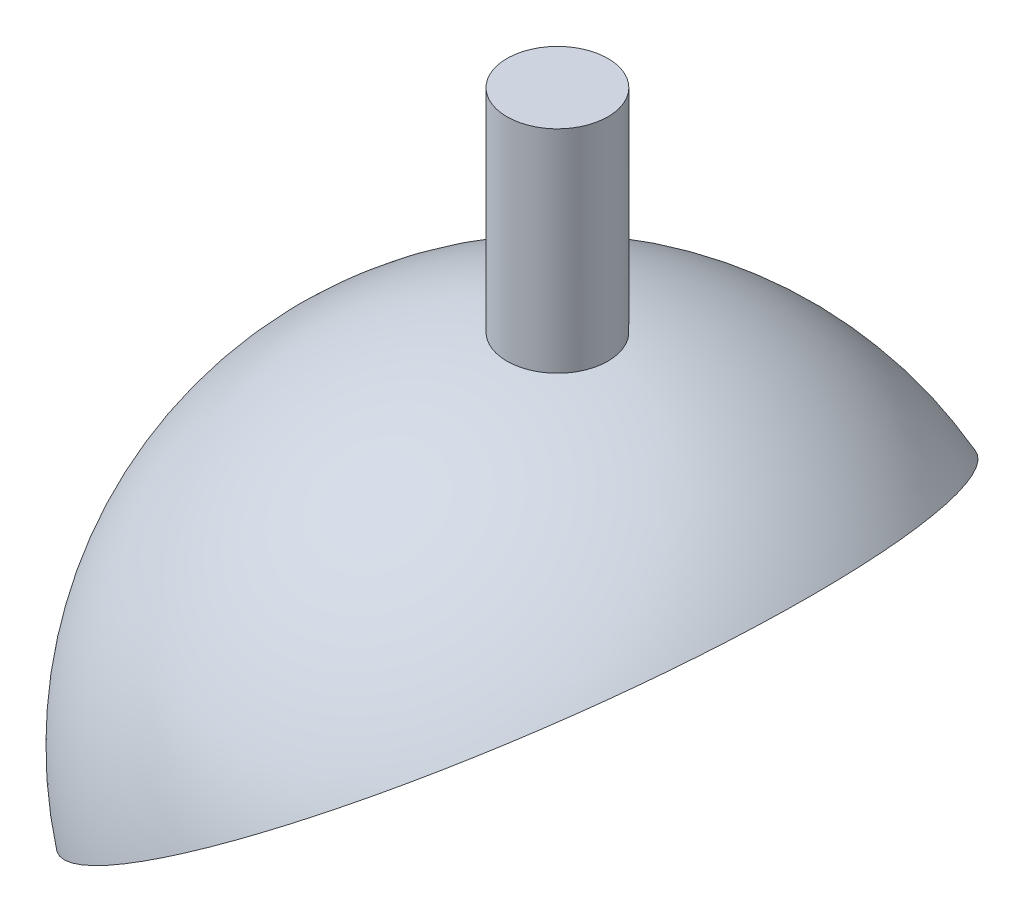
ISO-10303-21;
HEADER;
FILE_DESCRIPTION(('STEP AP214'),'2;1');
FILE_NAME('part.step','',(''),(''),'','','');
FILE_SCHEMA(('AUTOMOTIVE_DESIGN { 1 0 10303 214 1 1 1 1 }'));
ENDSEC;
DATA;
#1=APPLICATION_CONTEXT('core data for automotive mechanical design processes');
#2=APPLICATION_PROTOCOL_DEFINITION('international standard','automotive_design',2000,#1);
#3=PRODUCT_CONTEXT('',#1,'mechanical');
#4=PRODUCT('Part','Part','',(#3));
#5=PRODUCT_RELATED_PRODUCT_CATEGORY('part','',(#4));
#6=PRODUCT_DEFINITION_FORMATION('','',#4);
#7=PRODUCT_DEFINITION_CONTEXT('part definition',#1,'design');
#8=PRODUCT_DEFINITION('design','',#6,#7);
#9=PRODUCT_DEFINITION_SHAPE('','',#8);
#10=(LENGTH_UNIT() NAMED_UNIT(*) SI_UNIT(.MILLI.,.METRE.));
#11=(NAMED_UNIT(*) PLANE_ANGLE_UNIT() SI_UNIT($,.RADIAN.));
#12=(NAMED_UNIT(*) SI_UNIT($,.STERADIAN.) SOLID_ANGLE_UNIT());
#13=UNCERTAINTY_MEASURE_WITH_UNIT(LENGTH_MEASURE(1.E-05),#10,'distance_accuracy_value','');
#14=(GEOMETRIC_REPRESENTATION_CONTEXT(3) GLOBAL_UNCERTAINTY_ASSIGNED_CONTEXT((#13)) GLOBAL_UNIT_ASSIGNED_CONTEXT((#10,
#11,#12)) REPRESENTATION_CONTEXT('',''));
#15=CARTESIAN_POINT('',(0.,0.,0.));
#16=DIRECTION('',(0.,0.,1.));
#17=DIRECTION('',(1.,0.,0.));
#18=AXIS2_PLACEMENT_3D('',#15,#16,#17);
#19=CARTESIAN_POINT('',(0.,0.,0.));
#20=DIRECTION('',(-0.556232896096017,0.831026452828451,0.));
#21=DIRECTION('',(0.831026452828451,0.556232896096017,0.));
#22=AXIS2_PLACEMENT_3D('',#19,#20,#21);
#23=SPHERICAL_SURFACE('',#22,50.);
#24=CARTESIAN_POINT('',(-5.56232896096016,8.3102645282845,0.));
#25=DIRECTION('',(-0.556232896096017,0.831026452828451,0.));
#26=DIRECTION('',(-0.831026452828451,-0.556232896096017,0.));
#27=AXIS2_PLACEMENT_3D('',#24,#25,#26);
#28=CIRCLE('',#27,48.9897948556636);
#29=CARTESIAN_POINT('',(-46.2741444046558,-18.939470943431,0.));
#30=VERTEX_POINT('',#29);
#31=EDGE_CURVE('E78',#30,#30,#28,.T.);
#32=ORIENTED_EDGE('',*,*,#31,.T.);
#33=EDGE_LOOP('',(#32));
#34=FACE_BOUND('',#33,.T.);
#35=CARTESIAN_POINT('',(0.,49.5103077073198,0.));
#36=DIRECTION('',(0.,-1.,0.));
#37=DIRECTION('',(0.,0.,-1.));
#38=AXIS2_PLACEMENT_3D('',#35,#36,#37);
#39=CIRCLE('',#38,6.98064687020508);
#40=CARTESIAN_POINT('',(0.,49.5103077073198,-6.98064687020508));
#41=VERTEX_POINT('',#40);
#42=EDGE_CURVE('E11',#41,#41,#39,.F.);
#43=ORIENTED_EDGE('',*,*,#42,.F.);
#44=EDGE_LOOP('',(#43));
#45=FACE_BOUND('',#44,.T.);
#46=ADVANCED_FACE('F36',(#34,#45),#23,.T.);
#47=CARTESIAN_POINT('',(-23.9180145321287,35.7341374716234,0.));
#48=DIRECTION('',(0.556232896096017,-0.831026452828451,0.));
#49=DIRECTION('',(0.831026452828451,0.556232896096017,0.));
#50=AXIS2_PLACEMENT_3D('',#47,#48,#49);
#51=CONICAL_SURFACE('',#50,0.,1.39372087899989);
#52=CARTESIAN_POINT('',(-22.4336934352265,33.5165230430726,0.));
#53=DIRECTION('',(-0.556232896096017,0.831026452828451,0.));
#54=DIRECTION('',(-0.831026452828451,-0.556232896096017,0.));
#55=AXIS2_PLACEMENT_3D('',#52,#53,#54);
#56=CIRCLE('',#55,14.9121454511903);
#57=CARTESIAN_POINT('',(-34.8260807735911,25.221897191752,0.));
#58=VERTEX_POINT('',#57);
#59=EDGE_CURVE('E42',#58,#58,#56,.T.);
#60=ORIENTED_EDGE('',*,*,#59,.F.);
#61=EDGE_LOOP('',(#60));
#62=FACE_BOUND('',#61,.T.);
#63=CARTESIAN_POINT('',(-23.9180145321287,35.7341374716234,0.));
#64=VERTEX_POINT('',#63);
#65=VERTEX_LOOP('',#64);
#66=FACE_BOUND('',#65,.T.);
#67=ADVANCED_FACE('F45',(#62,#66),#51,.F.);
#68=CARTESIAN_POINT('',(-22.4336934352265,33.5165230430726,0.));
#69=DIRECTION('',(0.556232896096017,-0.831026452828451,0.));
#70=DIRECTION('',(0.831026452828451,0.556232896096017,0.));
#71=AXIS2_PLACEMENT_3D('',#68,#69,#70);
#72=CONICAL_SURFACE('',#71,14.9121454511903,0.964727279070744);
#73=CARTESIAN_POINT('',(-12.0598826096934,18.017779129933,0.));
#74=DIRECTION('',(-0.556232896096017,0.831026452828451,0.));
#75=DIRECTION('',(-0.831026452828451,-0.556232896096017,0.));
#76=AXIS2_PLACEMENT_3D('',#73,#74,#75);
#77=CIRCLE('',#76,41.821047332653);
#78=CARTESIAN_POINT('',(-46.8142792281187,-5.24446314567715,0.));
#79=VERTEX_POINT('',#78);
#80=EDGE_CURVE('E86',#79,#79,#77,.T.);
#81=ORIENTED_EDGE('',*,*,#80,.F.);
#82=EDGE_LOOP('',(#81));
#83=FACE_BOUND('',#82,.T.);
#84=ORIENTED_EDGE('',*,*,#59,.T.);
#85=EDGE_LOOP('',(#84));
#86=FACE_BOUND('',#85,.T.);
#87=ADVANCED_FACE('F47',(#83,#86),#72,.F.);
#88=CARTESIAN_POINT('',(-27.8116448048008,41.5513226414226,0.));
#89=DIRECTION('',(-0.556232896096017,0.831026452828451,0.));
#90=DIRECTION('',(-0.831026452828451,-0.556232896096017,0.));
#91=AXIS2_PLACEMENT_3D('',#88,#89,#90);
#92=CYLINDRICAL_SURFACE('',#91,41.821047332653);
#93=CARTESIAN_POINT('',(-5.56232896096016,8.3102645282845,0.));
#94=DIRECTION('',(-0.556232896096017,0.831026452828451,0.));
#95=DIRECTION('',(-0.831026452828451,-0.556232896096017,0.));
#96=AXIS2_PLACEMENT_3D('',#93,#94,#95);
#97=CIRCLE('',#96,41.821047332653);
#98=CARTESIAN_POINT('',(-40.3167255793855,-14.9519777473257,0.));
#99=VERTEX_POINT('',#98);
#100=EDGE_CURVE('E81',#99,#99,#97,.T.);
#101=ORIENTED_EDGE('',*,*,#100,.F.);
#102=EDGE_LOOP('',(#101));
#103=FACE_BOUND('',#102,.T.);
#104=ORIENTED_EDGE('',*,*,#80,.T.);
#105=EDGE_LOOP('',(#104));
#106=FACE_BOUND('',#105,.T.);
#107=ADVANCED_FACE('F53',(#103,#106),#92,.F.);
#108=CARTESIAN_POINT('',(35.1494864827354,35.56,0.));
#109=DIRECTION('',(-0.556232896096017,0.831026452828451,0.));
#110=DIRECTION('',(-0.831026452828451,-0.556232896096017,0.));
#111=AXIS2_PLACEMENT_3D('',#108,#109,#110);
#112=PLANE('',#111);
#113=ORIENTED_EDGE('',*,*,#31,.F.);
#114=EDGE_LOOP('',(#113));
#115=FACE_BOUND('',#114,.T.);
#116=ORIENTED_EDGE('',*,*,#100,.T.);
#117=EDGE_LOOP('',(#116));
#118=FACE_BOUND('',#117,.T.);
#119=ADVANCED_FACE('F61',(#115,#118),#112,.F.);
#120=CARTESIAN_POINT('',(0.,78.7655700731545,0.));
#121=DIRECTION('',(0.,1.,0.));
#122=DIRECTION('',(0.,0.,1.));
#123=AXIS2_PLACEMENT_3D('',#120,#121,#122);
#124=CYLINDRICAL_SURFACE('',#123,6.98064687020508);
#125=CARTESIAN_POINT('',(0.,78.7655700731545,0.));
#126=DIRECTION('',(0.,1.,0.));
#127=DIRECTION('',(0.,0.,1.));
#128=AXIS2_PLACEMENT_3D('',#125,#126,#127);
#129=CIRCLE('',#128,6.98064687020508);
#130=CARTESIAN_POINT('',(0.,78.7655700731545,6.98064687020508));
#131=VERTEX_POINT('',#130);
#132=EDGE_CURVE('E77',#131,#131,#129,.T.);
#133=ORIENTED_EDGE('',*,*,#132,.F.);
#134=EDGE_LOOP('',(#133));
#135=FACE_BOUND('',#134,.T.);
#136=ORIENTED_EDGE('',*,*,#42,.T.);
#137=EDGE_LOOP('',(#136));
#138=FACE_BOUND('',#137,.T.);
#139=ADVANCED_FACE('F65',(#135,#138),#124,.T.);
#140=CARTESIAN_POINT('',(6.98064687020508,78.7655700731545,0.));
#141=DIRECTION('',(0.,-1.,0.));
#142=DIRECTION('',(0.,0.,-1.));
#143=AXIS2_PLACEMENT_3D('',#140,#141,#142);
#144=PLANE('',#143);
#145=ORIENTED_EDGE('',*,*,#132,.T.);
#146=EDGE_LOOP('',(#145));
#147=FACE_BOUND('',#146,.T.);
#148=ADVANCED_FACE('F69',(#147),#144,.F.);
#149=CLOSED_SHELL('',(#46,#67,#87,#107,#119,#139,#148));
#150=MANIFOLD_SOLID_BREP('B2',#149);
#151=ADVANCED_BREP_SHAPE_REPRESENTATION('',(#18,#150),#14);
#152=SHAPE_DEFINITION_REPRESENTATION(#9,#151);
ENDSEC;
END-ISO-10303-21;
